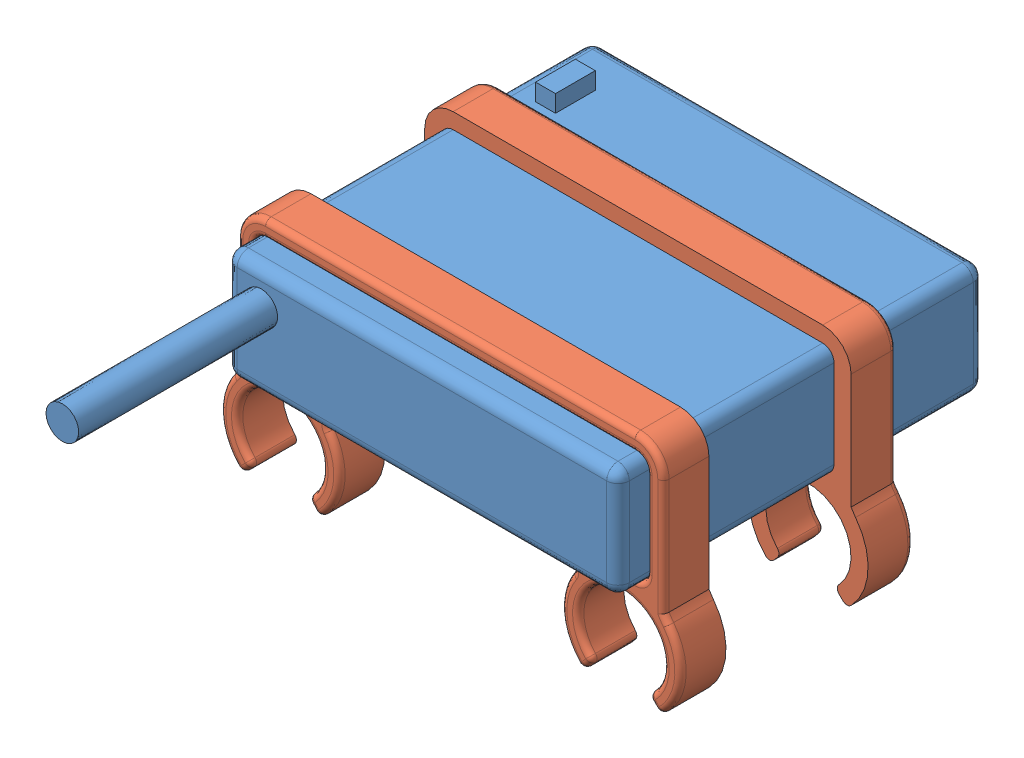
SolidWorks assembly Battery AAx4 Assy.SLDASM, configuration Default (file format 7000). Lengths in mm.
Overall size (81 40.78 99.5).
3 component instances, 2 part files, 6 mates.
Components (placement in the parent):
- Battery Pack-1: Battery Pack.SLDPRT [Default] at origin size (69 22.5 99.5)
- AAx4 - Battery Clip-1: AAx4 - Battery Clip.SLDPRT [Default] at (34.5 9.625 -38) x (0 0 -1) z (-1 0 0) size (8 40.53 81)
- AAx4 - Battery Clip-2: AAx4 - Battery Clip.SLDPRT [Default] at (34.5 9.625 -13) x (0 0 1) z (1 0 0) size (8 40.53 81)
Mates (geometry in assembly coordinates):
- Distance3: distance = 5 mm aligned: plane of AAx4 - Battery Clip-2 through (34.5 9.625 -5) normal (0 0 1); plane of Battery Pack-1 through (69 0 0) normal (0 0 1)
- Concentric1: concentric anti-aligned: cylinder of AAx4 - Battery Clip-1 through (4.5 -10.625 -46) axis (0 0 1) radius 7.5; cylinder of AAx4 - Battery Clip-2 through (4.5 -10.625 -5) axis (0 0 -1) radius 7.5
- Distance4: distance = 25 mm anti-aligned: plane of AAx4 - Battery Clip-1 through (34.5 9.625 -38) normal (0 0 1); plane of AAx4 - Battery Clip-2 through (34.5 9.625 -13) normal (0 0 -1)
- Coincident14: coincident anti-aligned: plane of Battery Pack-1 through (69 0 0) normal (0 -1 0); plane of AAx4 - Battery Clip-2 through (69 0 -5) normal (0 1 0)
- Coincident15: coincident anti-aligned: plane of Battery Pack-1 through (0 0 0) normal (-1 0 0); plane of AAx4 - Battery Clip-2 through (0 19.25 -5) normal (1 0 0)
- Coincident16: coincident anti-aligned: circle of AAx4 - Battery Clip-1; cylinder of AAx4 - Battery Clip-2 through (64.5 -10.625 -5) axis (0 0 -1) radius 7.5
